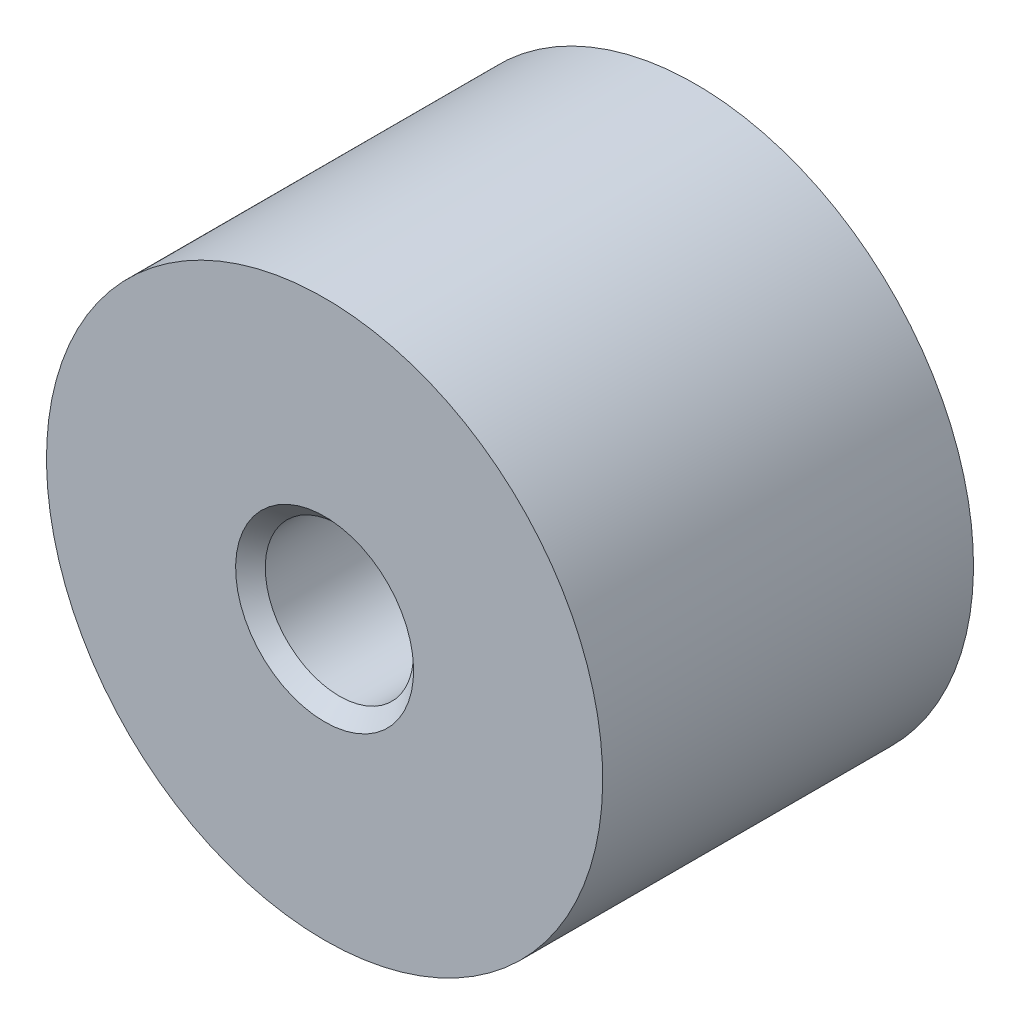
ISO-10303-21;
HEADER;
FILE_DESCRIPTION(('STEP AP214'),'2;1');
FILE_NAME('part.step','',(''),(''),'','','');
FILE_SCHEMA(('AUTOMOTIVE_DESIGN { 1 0 10303 214 1 1 1 1 }'));
ENDSEC;
DATA;
#1=APPLICATION_CONTEXT('core data for automotive mechanical design processes');
#2=APPLICATION_PROTOCOL_DEFINITION('international standard','automotive_design',2000,#1);
#3=PRODUCT_CONTEXT('',#1,'mechanical');
#4=PRODUCT('Part','Part','',(#3));
#5=PRODUCT_RELATED_PRODUCT_CATEGORY('part','',(#4));
#6=PRODUCT_DEFINITION_FORMATION('','',#4);
#7=PRODUCT_DEFINITION_CONTEXT('part definition',#1,'design');
#8=PRODUCT_DEFINITION('design','',#6,#7);
#9=PRODUCT_DEFINITION_SHAPE('','',#8);
#10=(LENGTH_UNIT() NAMED_UNIT(*) SI_UNIT(.MILLI.,.METRE.));
#11=(NAMED_UNIT(*) PLANE_ANGLE_UNIT() SI_UNIT($,.RADIAN.));
#12=(NAMED_UNIT(*) SI_UNIT($,.STERADIAN.) SOLID_ANGLE_UNIT());
#13=UNCERTAINTY_MEASURE_WITH_UNIT(LENGTH_MEASURE(1.E-05),#10,'distance_accuracy_value','');
#14=(GEOMETRIC_REPRESENTATION_CONTEXT(3) GLOBAL_UNCERTAINTY_ASSIGNED_CONTEXT((#13)) GLOBAL_UNIT_ASSIGNED_CONTEXT((#10,
#11,#12)) REPRESENTATION_CONTEXT('',''));
#15=CARTESIAN_POINT('',(0.,0.,0.));
#16=DIRECTION('',(0.,0.,1.));
#17=DIRECTION('',(1.,0.,0.));
#18=AXIS2_PLACEMENT_3D('',#15,#16,#17);
#19=CARTESIAN_POINT('',(7.,0.,10.));
#20=DIRECTION('',(0.,0.,1.));
#21=DIRECTION('',(0.,-1.,0.));
#22=AXIS2_PLACEMENT_3D('',#19,#20,#21);
#23=PLANE('',#22);
#24=CARTESIAN_POINT('',(0.,0.,10.));
#25=DIRECTION('',(0.,0.,1.));
#26=DIRECTION('',(0.,-1.,0.));
#27=AXIS2_PLACEMENT_3D('',#24,#25,#26);
#28=CIRCLE('',#27,2.4);
#29=CARTESIAN_POINT('',(0.,-2.4,10.));
#30=VERTEX_POINT('',#29);
#31=EDGE_CURVE('E8',#30,#30,#28,.F.);
#32=ORIENTED_EDGE('',*,*,#31,.T.);
#33=EDGE_LOOP('',(#32));
#34=FACE_BOUND('',#33,.T.);
#35=CARTESIAN_POINT('',(0.,0.,10.));
#36=DIRECTION('',(0.,0.,1.));
#37=DIRECTION('',(0.,-1.,0.));
#38=AXIS2_PLACEMENT_3D('',#35,#36,#37);
#39=CIRCLE('',#38,7.5);
#40=CARTESIAN_POINT('',(0.,-7.5,10.));
#41=VERTEX_POINT('',#40);
#42=EDGE_CURVE('E32',#41,#41,#39,.T.);
#43=ORIENTED_EDGE('',*,*,#42,.T.);
#44=EDGE_LOOP('',(#43));
#45=FACE_BOUND('',#44,.T.);
#46=ADVANCED_FACE('F12',(#34,#45),#23,.T.);
#47=CARTESIAN_POINT('',(0.,0.,0.33333333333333));
#48=DIRECTION('',(0.,0.,1.));
#49=DIRECTION('',(0.,-1.,0.));
#50=AXIS2_PLACEMENT_3D('',#47,#48,#49);
#51=CYLINDRICAL_SURFACE('',#50,7.5);
#52=CARTESIAN_POINT('',(0.,0.,0.));
#53=DIRECTION('',(0.,0.,1.));
#54=DIRECTION('',(0.,-1.,0.));
#55=AXIS2_PLACEMENT_3D('',#52,#53,#54);
#56=CIRCLE('',#55,7.5);
#57=CARTESIAN_POINT('',(0.,-7.5,0.));
#58=VERTEX_POINT('',#57);
#59=EDGE_CURVE('E35',#58,#58,#56,.T.);
#60=ORIENTED_EDGE('',*,*,#59,.T.);
#61=EDGE_LOOP('',(#60));
#62=FACE_BOUND('',#61,.T.);
#63=ORIENTED_EDGE('',*,*,#42,.F.);
#64=EDGE_LOOP('',(#63));
#65=FACE_BOUND('',#64,.T.);
#66=ADVANCED_FACE('F63',(#62,#65),#51,.T.);
#67=CARTESIAN_POINT('',(7.5,0.,0.));
#68=DIRECTION('',(0.,0.,-1.));
#69=DIRECTION('',(0.,1.,0.));
#70=AXIS2_PLACEMENT_3D('',#67,#68,#69);
#71=PLANE('',#70);
#72=CARTESIAN_POINT('',(0.,0.,0.));
#73=DIRECTION('',(0.,0.,-1.));
#74=DIRECTION('',(0.,1.,0.));
#75=AXIS2_PLACEMENT_3D('',#72,#73,#74);
#76=CIRCLE('',#75,2.4);
#77=CARTESIAN_POINT('',(0.,2.4,0.));
#78=VERTEX_POINT('',#77);
#79=EDGE_CURVE('E23',#78,#78,#76,.F.);
#80=ORIENTED_EDGE('',*,*,#79,.T.);
#81=EDGE_LOOP('',(#80));
#82=FACE_BOUND('',#81,.T.);
#83=ORIENTED_EDGE('',*,*,#59,.F.);
#84=EDGE_LOOP('',(#83));
#85=FACE_BOUND('',#84,.T.);
#86=ADVANCED_FACE('F68',(#82,#85),#71,.T.);
#87=CARTESIAN_POINT('',(0.,0.,0.));
#88=DIRECTION('',(0.,0.,1.));
#89=DIRECTION('',(0.,-1.,0.));
#90=AXIS2_PLACEMENT_3D('',#87,#88,#89);
#91=CYLINDRICAL_SURFACE('',#90,2.);
#92=CARTESIAN_POINT('',(0.,0.,0.399999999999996));
#93=DIRECTION('',(0.,0.,-1.));
#94=DIRECTION('',(0.,1.,0.));
#95=AXIS2_PLACEMENT_3D('',#92,#93,#94);
#96=CIRCLE('',#95,2.);
#97=CARTESIAN_POINT('',(0.,2.,0.399999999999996));
#98=VERTEX_POINT('',#97);
#99=EDGE_CURVE('E27',#98,#98,#96,.T.);
#100=ORIENTED_EDGE('',*,*,#99,.T.);
#101=EDGE_LOOP('',(#100));
#102=FACE_BOUND('',#101,.T.);
#103=CARTESIAN_POINT('',(0.,0.,4.));
#104=DIRECTION('',(0.,0.,-1.));
#105=DIRECTION('',(0.,1.,0.));
#106=AXIS2_PLACEMENT_3D('',#103,#104,#105);
#107=CIRCLE('',#106,2.);
#108=CARTESIAN_POINT('',(0.,2.,4.));
#109=VERTEX_POINT('',#108);
#110=EDGE_CURVE('E38',#109,#109,#107,.T.);
#111=ORIENTED_EDGE('',*,*,#110,.F.);
#112=EDGE_LOOP('',(#111));
#113=FACE_BOUND('',#112,.T.);
#114=ADVANCED_FACE('F58',(#102,#113),#91,.F.);
#115=CARTESIAN_POINT('',(0.,0.,4.));
#116=DIRECTION('',(0.,0.,-1.));
#117=DIRECTION('',(0.,1.,0.));
#118=AXIS2_PLACEMENT_3D('',#115,#116,#117);
#119=PLANE('',#118);
#120=ORIENTED_EDGE('',*,*,#110,.T.);
#121=EDGE_LOOP('',(#120));
#122=FACE_BOUND('',#121,.T.);
#123=ADVANCED_FACE('F49',(#122),#119,.T.);
#124=CARTESIAN_POINT('',(0.,0.,7.3333333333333));
#125=DIRECTION('',(0.,0.,1.));
#126=DIRECTION('',(0.,-1.,0.));
#127=AXIS2_PLACEMENT_3D('',#124,#125,#126);
#128=CYLINDRICAL_SURFACE('',#127,2.);
#129=CARTESIAN_POINT('',(0.,0.,9.6));
#130=DIRECTION('',(0.,0.,1.));
#131=DIRECTION('',(0.,-1.,0.));
#132=AXIS2_PLACEMENT_3D('',#129,#130,#131);
#133=CIRCLE('',#132,2.);
#134=CARTESIAN_POINT('',(0.,-2.,9.6));
#135=VERTEX_POINT('',#134);
#136=EDGE_CURVE('E19',#135,#135,#133,.T.);
#137=ORIENTED_EDGE('',*,*,#136,.T.);
#138=EDGE_LOOP('',(#137));
#139=FACE_BOUND('',#138,.T.);
#140=CARTESIAN_POINT('',(0.,0.,6.));
#141=DIRECTION('',(0.,0.,1.));
#142=DIRECTION('',(0.,-1.,0.));
#143=AXIS2_PLACEMENT_3D('',#140,#141,#142);
#144=CIRCLE('',#143,2.);
#145=CARTESIAN_POINT('',(0.,-2.,6.));
#146=VERTEX_POINT('',#145);
#147=EDGE_CURVE('E41',#146,#146,#144,.T.);
#148=ORIENTED_EDGE('',*,*,#147,.F.);
#149=EDGE_LOOP('',(#148));
#150=FACE_BOUND('',#149,.T.);
#151=ADVANCED_FACE('F47',(#139,#150),#128,.F.);
#152=CARTESIAN_POINT('',(0.,0.,6.));
#153=DIRECTION('',(0.,0.,1.));
#154=DIRECTION('',(0.,-1.,0.));
#155=AXIS2_PLACEMENT_3D('',#152,#153,#154);
#156=PLANE('',#155);
#157=ORIENTED_EDGE('',*,*,#147,.T.);
#158=EDGE_LOOP('',(#157));
#159=FACE_BOUND('',#158,.T.);
#160=ADVANCED_FACE('F45',(#159),#156,.T.);
#161=CARTESIAN_POINT('',(0.,0.,0.399999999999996));
#162=DIRECTION('',(0.,0.,-1.));
#163=DIRECTION('',(0.,1.,0.));
#164=AXIS2_PLACEMENT_3D('',#161,#162,#163);
#165=CONICAL_SURFACE('',#164,2.,0.785398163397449);
#166=ORIENTED_EDGE('',*,*,#79,.F.);
#167=EDGE_LOOP('',(#166));
#168=FACE_BOUND('',#167,.T.);
#169=ORIENTED_EDGE('',*,*,#99,.F.);
#170=EDGE_LOOP('',(#169));
#171=FACE_BOUND('',#170,.T.);
#172=ADVANCED_FACE('F56',(#168,#171),#165,.F.);
#173=CARTESIAN_POINT('',(0.,0.,9.6));
#174=DIRECTION('',(0.,0.,1.));
#175=DIRECTION('',(0.,-1.,0.));
#176=AXIS2_PLACEMENT_3D('',#173,#174,#175);
#177=CONICAL_SURFACE('',#176,2.,0.785398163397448);
#178=ORIENTED_EDGE('',*,*,#31,.F.);
#179=EDGE_LOOP('',(#178));
#180=FACE_BOUND('',#179,.T.);
#181=ORIENTED_EDGE('',*,*,#136,.F.);
#182=EDGE_LOOP('',(#181));
#183=FACE_BOUND('',#182,.T.);
#184=ADVANCED_FACE('F14',(#180,#183),#177,.F.);
#185=CLOSED_SHELL('',(#46,#66,#86,#114,#123,#151,#160,#172,#184));
#186=MANIFOLD_SOLID_BREP('B1',#185);
#187=ADVANCED_BREP_SHAPE_REPRESENTATION('',(#18,#186),#14);
#188=SHAPE_DEFINITION_REPRESENTATION(#9,#187);
ENDSEC;
END-ISO-10303-21;
